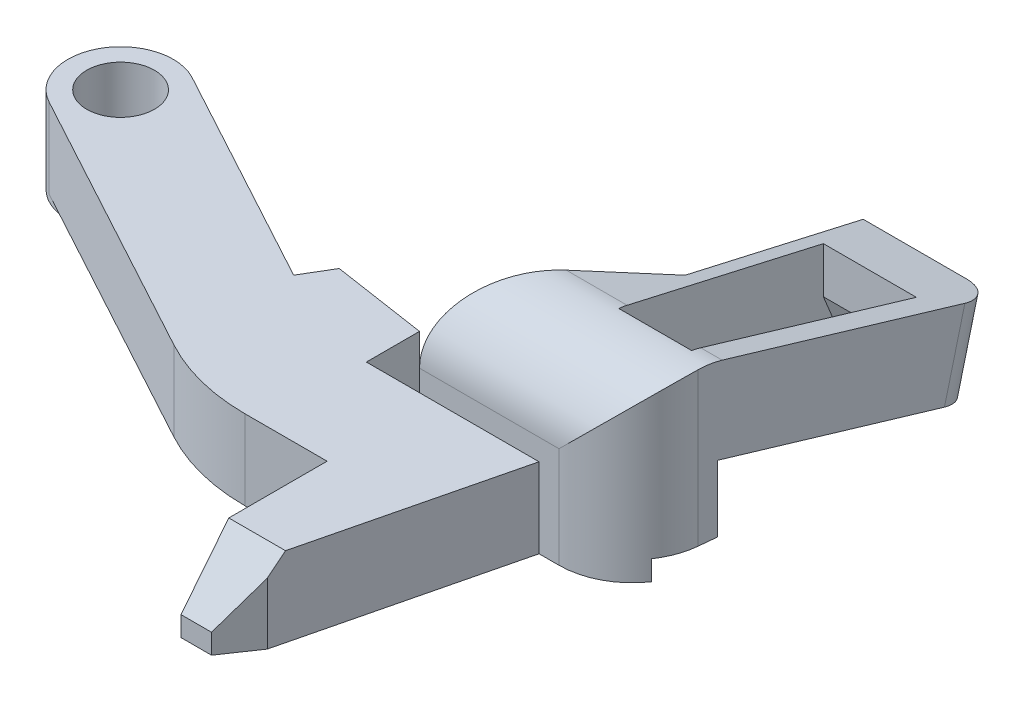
from build123d import *

# Parameters (mm, degrees)
SKETCH1_R               = 3.2385
BOSS_EXTRUDE1_DEPTH     = 7.62
BOSS_EXTRUDE2_START     = 0.635
SKETCH2_R               = 5.0419
SKETCH2_R_2             = 3.2385
BOSS_EXTRUDE2_DEPTH     = 0.635
BOSS_EXTRUDE3_DEPTH     = 10.16
BOSS_EXTRUDE4_DEPTH     = 22.86
CUT_EXTRUDE2_DEPTH      = 74.83091465
CUT_EXTRUDE3_DEPTH      = 74.83091465
CUT_EXTRUDE4_DEPTH      = 74.83091465
CUT_EXTRUDE5_DEPTH      = 59.824997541
CUT_EXTRUDE5_DEPTH_BACK = 59.824997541
FILLET1_R               = 19.05
FILLET2_R               = 2.54
CUT_EXTRUDE8_DEPTH      = 74.615760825
CHAMFER2_SIZE           = 3.81
CHAMFER2_SIZE2          = 1.778


with BuildPart() as part:
    # Sketch1 → Boss-Extrude1 (new body)
    with BuildSketch(Plane(origin=(0, 0, 0), x_dir=(1, 0, 0), z_dir=(0, 1, 0))):
        with BuildLine():
            Line((2.403696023, 4.432042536), (30.48, -10.795))
            Line((30.48, -10.795), (50.8, -10.795))
            Line((50.8, -10.795), (45.701573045, -31.6738))
            Line((45.701573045, -31.6738), (43.542573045, -34.8488))
            Line((43.542573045, -34.8488), (40.621573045, -34.8488))
            Line((40.621573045, -34.8488), (40.621573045, -31.6738))
            Line((40.621573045, -31.6738), (40.621573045, -20.8788))
            Line((40.621573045, -20.8788), (27.921573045, -20.8788))
            Line((27.921573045, -20.8788), (-2.403696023, -4.432042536))
            ThreePointArc((-2.403696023, -4.432042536), (-4.432042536, 2.403696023), (2.403696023, 4.432042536))
        make_face()
        with Locations(Location((0, 0, 0), (0, 0, 90))):
            Circle(SKETCH1_R, mode=Mode.SUBTRACT)
    extrude(amount=BOSS_EXTRUDE1_DEPTH)

    # Sketch2 → Boss-Extrude2 (add)
    with BuildSketch(Plane.XZ.offset(BOSS_EXTRUDE2_START)):
        with Locations(Location((0, 0, 0), (0, 0, 270))):
            Circle(SKETCH2_R)
        with Locations(Location((0, 0, 0), (0, 0, 270))):
            Circle(SKETCH2_R_2, mode=Mode.SUBTRACT)
    extrude(amount=-BOSS_EXTRUDE2_DEPTH)

    # Sketch3 → Boss-Extrude3 (add)
    with BuildSketch(Plane(origin=(0, 7.62, 0), x_dir=(1, 0, 0), z_dir=(0, 1, 0))):
        Polygon((34.29, -10.795), (34.29, -5.715), (25.248618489, -4.348926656), (23.622, -7.075598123), (30.48, -10.795), align=None)
    extrude(amount=-BOSS_EXTRUDE3_DEPTH)

    # Sketch4 → Boss-Extrude4 (add)
    with BuildSketch(Plane.ZY.offset(-39.37)):
        with BuildLine():
            Line((10.795, 7.62), (10.795, 0))
            Line((10.795, 0), (7.747, 0))
            Line((7.747, 0), (7.747, 1.905))
            Line((7.747, 1.905), (2.794, 1.905))
            Line((2.794, 1.905), (2.794, 8.255))
            Line((2.794, 8.255), (-19.685, 3.131560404))
            Line((-19.685, 3.131560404), (-21.463, 10.932503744))
            Line((-21.463, 10.932503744), (2.378069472, 16.366387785))
            ThreePointArc((2.378069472, 16.366387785), (8.202957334, 15.035486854), (10.795, 9.652))
            Line((10.795, 9.652), (10.795, 7.62))
        make_face()
    extrude(amount=-BOSS_EXTRUDE4_DEPTH)

    # Sketch8 → Cut-Extrude2 (cut, through all)
    with BuildSketch(Plane(origin=(0, 16.538579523, 0), x_dir=(1, 0, 0), z_dir=(0, 1, 0))):
        Polygon((39.37, -10.795), (39.37, -2.378069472), (39.37, 21.463), (36.83, 21.463), (36.83, -10.795), align=None)
        Polygon((39.37, 21.463), (39.37, -2.378069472), (39.37, -10.795), (49.53, 4.445), (49.53, 21.463), align=None)
    extrude(amount=-CUT_EXTRUDE2_DEPTH, mode=Mode.SUBTRACT)

    # Sketch9 → Cut-Extrude3 (cut, through all)
    with BuildSketch(Plane(origin=(0, 16.538579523, 0), x_dir=(1, 0, 0), z_dir=(0, 1, 0))):
        Polygon((58.58355503, -15.584880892), (62.23, 21.463), (71.162064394, 21.463), (71.162064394, -15.584880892), align=None)
    extrude(amount=-CUT_EXTRUDE3_DEPTH, mode=Mode.SUBTRACT)

    # Sketch10 → Cut-Extrude4 (cut, through all)
    with BuildSketch(Plane(origin=(0, 16.538579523, 0), x_dir=(1, 0, 0), z_dir=(0, 1, 0))):
        Polygon((50.8, 16.383), (59.688181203, 16.383), (57.763181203, -3.175), (50.8, -3.175), align=None)
    extrude(amount=-CUT_EXTRUDE4_DEPTH, mode=Mode.SUBTRACT)

    # Sketch11 → Cut-Extrude5 (cut, two sides: drawn at the far end of the back side and taken through both)
    with BuildSketch(Plane(origin=(39.37, 0, 0), x_dir=(0, 0, -1), z_dir=(1, 0, 0)).offset(-CUT_EXTRUDE5_DEPTH_BACK)):
        Polygon((-30.2768, 7.62), (-34.8488, 1.905), (-34.8488, 7.62), align=None)
    extrude(amount=CUT_EXTRUDE5_DEPTH + CUT_EXTRUDE5_DEPTH_BACK, mode=Mode.SUBTRACT)

    # Fillet1
    fillet1_edges = [part.edges().sort_by_distance(p)[0] for p in [
        (27.921573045, 3.81, 20.8788),
    ]]
    fillet(fillet1_edges, radius=FILLET1_R)

    # Fillet2
    fillet2_edges = [part.edges().sort_by_distance(p)[0] for p in [
        (62.1425, 7.032032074, -20.574),
    ]]
    fillet(fillet2_edges, radius=FILLET2_R)

    # Sketch12 → Cut-Extrude8 (cut, through all)
    with BuildSketch(Plane(origin=(0, 16.538579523, 0), x_dir=(1, 0, 0), z_dir=(0, 1, 0))):
        with BuildLine():
            ThreePointArc((52.705, -10.795), (57.409899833, -8.980031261), (59.67699447, -4.475536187))
            Line((59.67699447, -4.475536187), (62.077753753, -4.475536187))
            Line((62.077753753, -4.475536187), (62.077753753, -15.353243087))
            Line((62.077753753, -15.353243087), (52.705, -15.353243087))
            Line((52.705, -15.353243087), (52.705, -10.795))
        make_face()
    extrude(amount=-CUT_EXTRUDE8_DEPTH, mode=Mode.SUBTRACT)

    # Chamfer2
    chamfer2_edges = [part.edges().sort_by_distance(p)[0] for p in [
        (55.244090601, 3.88415605, -16.383),
    ]]
    chamfer2_side = [part.faces().sort_by_distance(p)[0] for p in [
        (55.244090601, 7.987249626, -16.383),
    ]]
    chamfer(chamfer2_edges, length=CHAMFER2_SIZE, length2=CHAMFER2_SIZE2, reference=chamfer2_side[0])


solid = part.part
